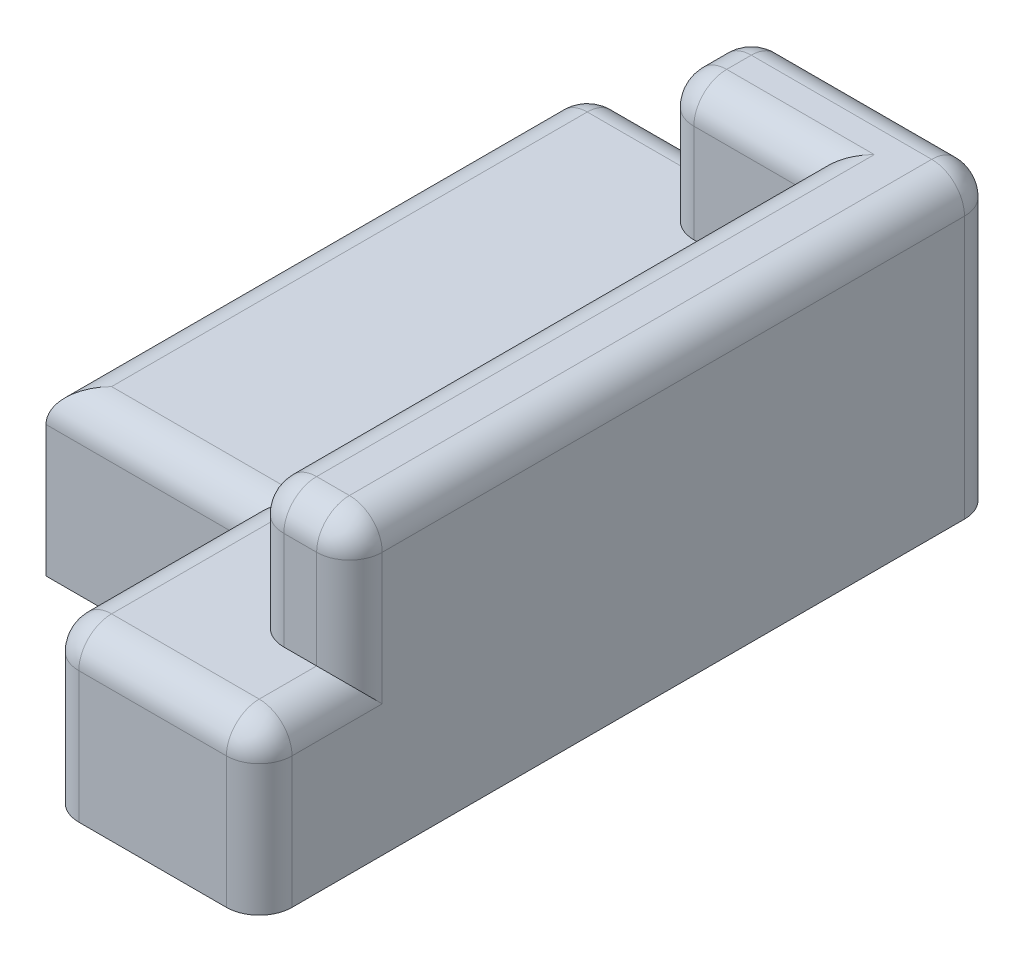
ISO-10303-21;
HEADER;
FILE_DESCRIPTION(('STEP AP214'),'2;1');
FILE_NAME('part.step','',(''),(''),'','','');
FILE_SCHEMA(('AUTOMOTIVE_DESIGN { 1 0 10303 214 1 1 1 1 }'));
ENDSEC;
DATA;
#1=APPLICATION_CONTEXT('core data for automotive mechanical design processes');
#2=APPLICATION_PROTOCOL_DEFINITION('international standard','automotive_design',2000,#1);
#3=PRODUCT_CONTEXT('',#1,'mechanical');
#4=PRODUCT('Part','Part','',(#3));
#5=PRODUCT_RELATED_PRODUCT_CATEGORY('part','',(#4));
#6=PRODUCT_DEFINITION_FORMATION('','',#4);
#7=PRODUCT_DEFINITION_CONTEXT('part definition',#1,'design');
#8=PRODUCT_DEFINITION('design','',#6,#7);
#9=PRODUCT_DEFINITION_SHAPE('','',#8);
#10=(LENGTH_UNIT() NAMED_UNIT(*) SI_UNIT(.MILLI.,.METRE.));
#11=(NAMED_UNIT(*) PLANE_ANGLE_UNIT() SI_UNIT($,.RADIAN.));
#12=(NAMED_UNIT(*) SI_UNIT($,.STERADIAN.) SOLID_ANGLE_UNIT());
#13=UNCERTAINTY_MEASURE_WITH_UNIT(LENGTH_MEASURE(1.E-05),#10,'distance_accuracy_value','');
#14=(GEOMETRIC_REPRESENTATION_CONTEXT(3) GLOBAL_UNCERTAINTY_ASSIGNED_CONTEXT((#13)) GLOBAL_UNIT_ASSIGNED_CONTEXT((#10,
#11,#12)) REPRESENTATION_CONTEXT('',''));
#15=CARTESIAN_POINT('',(0.,0.,0.));
#16=DIRECTION('',(0.,0.,1.));
#17=DIRECTION('',(1.,0.,0.));
#18=AXIS2_PLACEMENT_3D('',#15,#16,#17);
#19=CARTESIAN_POINT('',(0.,10.,0.));
#20=DIRECTION('',(-1.,0.,0.));
#21=DIRECTION('',(0.,0.,1.));
#22=AXIS2_PLACEMENT_3D('',#19,#20,#21);
#23=PLANE('',#22);
#24=DIRECTION('',(0.,0.,-1.));
#25=VECTOR('',#24,1.);
#26=CARTESIAN_POINT('',(0.,8.,-45.));
#27=LINE('',#26,#25);
#28=CARTESIAN_POINT('',(0.,8.,-12.));
#29=VERTEX_POINT('',#28);
#30=CARTESIAN_POINT('',(0.,8.,-43.));
#31=VERTEX_POINT('',#30);
#32=EDGE_CURVE('E57',#29,#31,#27,.T.);
#33=ORIENTED_EDGE('',*,*,#32,.T.);
#34=DIRECTION('',(0.,-1.,0.));
#35=VECTOR('',#34,1.);
#36=CARTESIAN_POINT('',(0.,10.,-43.));
#37=LINE('',#36,#35);
#38=CARTESIAN_POINT('',(0.,0.,-43.));
#39=VERTEX_POINT('',#38);
#40=EDGE_CURVE('E428',#31,#39,#37,.T.);
#41=ORIENTED_EDGE('',*,*,#40,.T.);
#42=DIRECTION('',(0.,0.,-1.));
#43=VECTOR('',#42,1.);
#44=CARTESIAN_POINT('',(0.,0.,0.));
#45=LINE('',#44,#43);
#46=CARTESIAN_POINT('',(0.,0.,-12.));
#47=VERTEX_POINT('',#46);
#48=EDGE_CURVE('E286',#47,#39,#45,.T.);
#49=ORIENTED_EDGE('',*,*,#48,.F.);
#50=DIRECTION('',(0.,-1.,0.));
#51=VECTOR('',#50,1.);
#52=CARTESIAN_POINT('',(0.,0.,-12.));
#53=LINE('',#52,#51);
#54=EDGE_CURVE('E224',#29,#47,#53,.T.);
#55=ORIENTED_EDGE('',*,*,#54,.F.);
#56=EDGE_LOOP('',(#33,#41,#49,#55));
#57=FACE_BOUND('',#56,.T.);
#58=ADVANCED_FACE('F39',(#57),#23,.T.);
#59=CARTESIAN_POINT('',(0.,10.,0.));
#60=DIRECTION('',(0.,-1.,0.));
#61=DIRECTION('',(0.,0.,-1.));
#62=AXIS2_PLACEMENT_3D('',#59,#60,#61);
#63=PLANE('',#62);
#64=DIRECTION('',(-1.,0.,0.));
#65=VECTOR('',#64,1.);
#66=CARTESIAN_POINT('',(0.,10.,-2.));
#67=LINE('',#66,#65);
#68=CARTESIAN_POINT('',(14.,10.,-2.));
#69=VERTEX_POINT('',#68);
#70=CARTESIAN_POINT('',(23.,10.,-2.));
#71=VERTEX_POINT('',#70);
#72=EDGE_CURVE('E404',#69,#71,#67,.F.);
#73=ORIENTED_EDGE('',*,*,#72,.T.);
#74=DIRECTION('',(0.,0.,1.));
#75=VECTOR('',#74,1.);
#76=CARTESIAN_POINT('',(23.,10.,0.));
#77=LINE('',#76,#75);
#78=CARTESIAN_POINT('',(23.,10.,-5.5));
#79=VERTEX_POINT('',#78);
#80=EDGE_CURVE('E407',#71,#79,#77,.F.);
#81=ORIENTED_EDGE('',*,*,#80,.T.);
#82=DIRECTION('',(-1.,0.,0.));
#83=VECTOR('',#82,1.);
#84=CARTESIAN_POINT('',(25.,10.,-5.5));
#85=LINE('',#84,#83);
#86=CARTESIAN_POINT('',(21.,10.,-5.5));
#87=VERTEX_POINT('',#86);
#88=EDGE_CURVE('E246',#79,#87,#85,.T.);
#89=ORIENTED_EDGE('',*,*,#88,.T.);
#90=CARTESIAN_POINT('',(21.,10.,-7.5));
#91=DIRECTION('',(0.,-1.,0.));
#92=DIRECTION('',(0.,0.,-1.));
#93=AXIS2_PLACEMENT_3D('',#90,#91,#92);
#94=CIRCLE('',#93,2.);
#95=CARTESIAN_POINT('',(19.,10.,-7.5));
#96=VERTEX_POINT('',#95);
#97=EDGE_CURVE('E49',#87,#96,#94,.T.);
#98=ORIENTED_EDGE('',*,*,#97,.T.);
#99=DIRECTION('',(0.,0.,1.));
#100=VECTOR('',#99,1.);
#101=CARTESIAN_POINT('',(19.,10.,-39.5));
#102=LINE('',#101,#100);
#103=CARTESIAN_POINT('',(19.,10.,-39.5));
#104=VERTEX_POINT('',#103);
#105=EDGE_CURVE('E275',#104,#96,#102,.T.);
#106=ORIENTED_EDGE('',*,*,#105,.F.);
#107=DIRECTION('',(1.,0.,0.));
#108=VECTOR('',#107,1.);
#109=CARTESIAN_POINT('',(0.,10.,-39.5));
#110=LINE('',#109,#108);
#111=CARTESIAN_POINT('',(12.,10.,-39.5));
#112=VERTEX_POINT('',#111);
#113=EDGE_CURVE('E279',#112,#104,#110,.T.);
#114=ORIENTED_EDGE('',*,*,#113,.F.);
#115=CARTESIAN_POINT('',(12.,10.,-41.5));
#116=DIRECTION('',(0.,-1.,0.));
#117=DIRECTION('',(0.,0.,-1.));
#118=AXIS2_PLACEMENT_3D('',#115,#116,#117);
#119=CIRCLE('',#118,2.);
#120=CARTESIAN_POINT('',(10.,10.,-41.5));
#121=VERTEX_POINT('',#120);
#122=EDGE_CURVE('E11',#112,#121,#119,.T.);
#123=ORIENTED_EDGE('',*,*,#122,.T.);
#124=DIRECTION('',(0.,0.,-1.));
#125=VECTOR('',#124,1.);
#126=CARTESIAN_POINT('',(10.,10.,-9.76786250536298));
#127=LINE('',#126,#125);
#128=CARTESIAN_POINT('',(10.,10.,-43.));
#129=VERTEX_POINT('',#128);
#130=EDGE_CURVE('E233',#121,#129,#127,.T.);
#131=ORIENTED_EDGE('',*,*,#130,.T.);
#132=DIRECTION('',(-1.,0.,0.));
#133=VECTOR('',#132,1.);
#134=CARTESIAN_POINT('',(0.,10.,-43.));
#135=LINE('',#134,#133);
#136=CARTESIAN_POINT('',(2.,10.,-43.));
#137=VERTEX_POINT('',#136);
#138=EDGE_CURVE('E392',#129,#137,#135,.T.);
#139=ORIENTED_EDGE('',*,*,#138,.T.);
#140=DIRECTION('',(0.,0.,-1.));
#141=VECTOR('',#140,1.);
#142=CARTESIAN_POINT('',(2.,10.,-12.));
#143=LINE('',#142,#141);
#144=CARTESIAN_POINT('',(2.,10.,-14.));
#145=VERTEX_POINT('',#144);
#146=EDGE_CURVE('E395',#137,#145,#143,.F.);
#147=ORIENTED_EDGE('',*,*,#146,.T.);
#148=DIRECTION('',(1.,0.,0.));
#149=VECTOR('',#148,1.);
#150=CARTESIAN_POINT('',(0.,10.,-14.));
#151=LINE('',#150,#149);
#152=CARTESIAN_POINT('',(14.,10.,-14.));
#153=VERTEX_POINT('',#152);
#154=EDGE_CURVE('E398',#145,#153,#151,.T.);
#155=ORIENTED_EDGE('',*,*,#154,.T.);
#156=DIRECTION('',(0.,0.,-1.));
#157=VECTOR('',#156,1.);
#158=CARTESIAN_POINT('',(14.,10.,0.));
#159=LINE('',#158,#157);
#160=EDGE_CURVE('E401',#153,#69,#159,.F.);
#161=ORIENTED_EDGE('',*,*,#160,.T.);
#162=EDGE_LOOP('',(#73,#81,#89,#98,#106,#114,#123,#131,#139,#147,#155,#161));
#163=FACE_BOUND('',#162,.T.);
#164=ADVANCED_FACE('F552',(#163),#63,.F.);
#165=CARTESIAN_POINT('',(0.,10.,0.));
#166=DIRECTION('',(0.,0.,-1.));
#167=DIRECTION('',(-1.,0.,0.));
#168=AXIS2_PLACEMENT_3D('',#165,#166,#167);
#169=PLANE('',#168);
#170=DIRECTION('',(1.,0.,0.));
#171=VECTOR('',#170,1.);
#172=CARTESIAN_POINT('',(0.,0.,0.));
#173=LINE('',#172,#171);
#174=CARTESIAN_POINT('',(14.,0.,0.));
#175=VERTEX_POINT('',#174);
#176=CARTESIAN_POINT('',(23.,0.,0.));
#177=VERTEX_POINT('',#176);
#178=EDGE_CURVE('E296',#175,#177,#173,.T.);
#179=ORIENTED_EDGE('',*,*,#178,.T.);
#180=DIRECTION('',(0.,-1.,0.));
#181=VECTOR('',#180,1.);
#182=CARTESIAN_POINT('',(23.,10.,0.));
#183=LINE('',#182,#181);
#184=CARTESIAN_POINT('',(23.,8.,0.));
#185=VERTEX_POINT('',#184);
#186=EDGE_CURVE('E416',#177,#185,#183,.F.);
#187=ORIENTED_EDGE('',*,*,#186,.T.);
#188=DIRECTION('',(-1.,0.,0.));
#189=VECTOR('',#188,1.);
#190=CARTESIAN_POINT('',(0.,8.,0.));
#191=LINE('',#190,#189);
#192=CARTESIAN_POINT('',(14.,8.,0.));
#193=VERTEX_POINT('',#192);
#194=EDGE_CURVE('E413',#185,#193,#191,.T.);
#195=ORIENTED_EDGE('',*,*,#194,.T.);
#196=DIRECTION('',(0.,1.,0.));
#197=VECTOR('',#196,1.);
#198=CARTESIAN_POINT('',(14.,0.,0.));
#199=LINE('',#198,#197);
#200=EDGE_CURVE('E410',#193,#175,#199,.F.);
#201=ORIENTED_EDGE('',*,*,#200,.T.);
#202=EDGE_LOOP('',(#179,#187,#195,#201));
#203=FACE_BOUND('',#202,.T.);
#204=ADVANCED_FACE('F625',(#203),#169,.F.);
#205=CARTESIAN_POINT('',(25.,10.,0.));
#206=DIRECTION('',(-1.,0.,0.));
#207=DIRECTION('',(0.,0.,1.));
#208=AXIS2_PLACEMENT_3D('',#205,#206,#207);
#209=PLANE('',#208);
#210=DIRECTION('',(0.,0.,-1.));
#211=VECTOR('',#210,1.);
#212=CARTESIAN_POINT('',(25.,0.,0.));
#213=LINE('',#212,#211);
#214=CARTESIAN_POINT('',(25.,0.,-2.));
#215=VERTEX_POINT('',#214);
#216=CARTESIAN_POINT('',(25.,0.,-43.));
#217=VERTEX_POINT('',#216);
#218=EDGE_CURVE('E292',#215,#217,#213,.T.);
#219=ORIENTED_EDGE('',*,*,#218,.T.);
#220=DIRECTION('',(0.,-1.,0.));
#221=VECTOR('',#220,1.);
#222=CARTESIAN_POINT('',(25.,18.,-43.));
#223=LINE('',#222,#221);
#224=CARTESIAN_POINT('',(25.,16.,-43.));
#225=VERTEX_POINT('',#224);
#226=EDGE_CURVE('E369',#217,#225,#223,.F.);
#227=ORIENTED_EDGE('',*,*,#226,.T.);
#228=DIRECTION('',(0.,0.,1.));
#229=VECTOR('',#228,1.);
#230=CARTESIAN_POINT('',(25.,16.,0.));
#231=LINE('',#230,#229);
#232=CARTESIAN_POINT('',(25.,16.,-7.5));
#233=VERTEX_POINT('',#232);
#234=EDGE_CURVE('E366',#225,#233,#231,.T.);
#235=ORIENTED_EDGE('',*,*,#234,.T.);
#236=DIRECTION('',(0.,-1.,0.));
#237=VECTOR('',#236,1.);
#238=CARTESIAN_POINT('',(25.,10.,-7.5));
#239=LINE('',#238,#237);
#240=CARTESIAN_POINT('',(25.,8.,-7.5));
#241=VERTEX_POINT('',#240);
#242=EDGE_CURVE('E363',#233,#241,#239,.T.);
#243=ORIENTED_EDGE('',*,*,#242,.T.);
#244=DIRECTION('',(0.,0.,1.));
#245=VECTOR('',#244,1.);
#246=CARTESIAN_POINT('',(25.,8.,0.));
#247=LINE('',#246,#245);
#248=CARTESIAN_POINT('',(25.,8.,-2.));
#249=VERTEX_POINT('',#248);
#250=EDGE_CURVE('E360',#241,#249,#247,.T.);
#251=ORIENTED_EDGE('',*,*,#250,.T.);
#252=DIRECTION('',(0.,-1.,0.));
#253=VECTOR('',#252,1.);
#254=CARTESIAN_POINT('',(25.,10.,-2.));
#255=LINE('',#254,#253);
#256=EDGE_CURVE('E357',#249,#215,#255,.T.);
#257=ORIENTED_EDGE('',*,*,#256,.T.);
#258=EDGE_LOOP('',(#219,#227,#235,#243,#251,#257));
#259=FACE_BOUND('',#258,.T.);
#260=ADVANCED_FACE('F1012',(#259),#209,.F.);
#261=CARTESIAN_POINT('',(0.,10.,-45.));
#262=DIRECTION('',(0.,0.,-1.));
#263=DIRECTION('',(-1.,0.,0.));
#264=AXIS2_PLACEMENT_3D('',#261,#262,#263);
#265=PLANE('',#264);
#266=DIRECTION('',(-1.,0.,0.));
#267=VECTOR('',#266,1.);
#268=CARTESIAN_POINT('',(25.,16.,-45.));
#269=LINE('',#268,#267);
#270=CARTESIAN_POINT('',(12.,16.,-45.));
#271=VERTEX_POINT('',#270);
#272=CARTESIAN_POINT('',(23.,16.,-45.));
#273=VERTEX_POINT('',#272);
#274=EDGE_CURVE('E350',#271,#273,#269,.F.);
#275=ORIENTED_EDGE('',*,*,#274,.T.);
#276=DIRECTION('',(0.,-1.,0.));
#277=VECTOR('',#276,1.);
#278=CARTESIAN_POINT('',(23.,0.,-45.));
#279=LINE('',#278,#277);
#280=CARTESIAN_POINT('',(23.,0.,-45.));
#281=VERTEX_POINT('',#280);
#282=EDGE_CURVE('E354',#273,#281,#279,.T.);
#283=ORIENTED_EDGE('',*,*,#282,.T.);
#284=DIRECTION('',(1.,0.,0.));
#285=VECTOR('',#284,1.);
#286=CARTESIAN_POINT('',(0.,0.,-45.));
#287=LINE('',#286,#285);
#288=CARTESIAN_POINT('',(2.,0.,-45.));
#289=VERTEX_POINT('',#288);
#290=EDGE_CURVE('E289',#289,#281,#287,.T.);
#291=ORIENTED_EDGE('',*,*,#290,.F.);
#292=DIRECTION('',(0.,-1.,0.));
#293=VECTOR('',#292,1.);
#294=CARTESIAN_POINT('',(2.,10.,-45.));
#295=LINE('',#294,#293);
#296=CARTESIAN_POINT('',(2.,8.,-45.));
#297=VERTEX_POINT('',#296);
#298=EDGE_CURVE('E347',#289,#297,#295,.F.);
#299=ORIENTED_EDGE('',*,*,#298,.T.);
#300=DIRECTION('',(-1.,0.,0.));
#301=VECTOR('',#300,1.);
#302=CARTESIAN_POINT('',(10.,8.,-45.));
#303=LINE('',#302,#301);
#304=CARTESIAN_POINT('',(12.,8.,-45.));
#305=VERTEX_POINT('',#304);
#306=EDGE_CURVE('E344',#297,#305,#303,.F.);
#307=ORIENTED_EDGE('',*,*,#306,.T.);
#308=DIRECTION('',(0.,-1.,0.));
#309=VECTOR('',#308,1.);
#310=CARTESIAN_POINT('',(12.,18.,-45.));
#311=LINE('',#310,#309);
#312=EDGE_CURVE('E341',#305,#271,#311,.F.);
#313=ORIENTED_EDGE('',*,*,#312,.T.);
#314=EDGE_LOOP('',(#275,#283,#291,#299,#307,#313));
#315=FACE_BOUND('',#314,.T.);
#316=ADVANCED_FACE('F629',(#315),#265,.T.);
#317=CARTESIAN_POINT('',(0.,0.,0.));
#318=DIRECTION('',(0.,-1.,0.));
#319=DIRECTION('',(0.,0.,-1.));
#320=AXIS2_PLACEMENT_3D('',#317,#318,#319);
#321=PLANE('',#320);
#322=ORIENTED_EDGE('',*,*,#290,.T.);
#323=CARTESIAN_POINT('',(23.,0.,-43.));
#324=DIRECTION('',(0.,-1.,0.));
#325=DIRECTION('',(0.,0.,-1.));
#326=AXIS2_PLACEMENT_3D('',#323,#324,#325);
#327=CIRCLE('',#326,2.);
#328=EDGE_CURVE('E389',#281,#217,#327,.T.);
#329=ORIENTED_EDGE('',*,*,#328,.T.);
#330=ORIENTED_EDGE('',*,*,#218,.F.);
#331=CARTESIAN_POINT('',(23.,0.,-2.));
#332=DIRECTION('',(0.,-1.,0.));
#333=DIRECTION('',(0.,0.,-1.));
#334=AXIS2_PLACEMENT_3D('',#331,#332,#333);
#335=CIRCLE('',#334,2.);
#336=EDGE_CURVE('E386',#215,#177,#335,.T.);
#337=ORIENTED_EDGE('',*,*,#336,.T.);
#338=ORIENTED_EDGE('',*,*,#178,.F.);
#339=CARTESIAN_POINT('',(14.,0.,-2.));
#340=DIRECTION('',(0.,-1.,0.));
#341=DIRECTION('',(0.,0.,-1.));
#342=AXIS2_PLACEMENT_3D('',#339,#340,#341);
#343=CIRCLE('',#342,2.);
#344=CARTESIAN_POINT('',(12.,0.,-2.));
#345=VERTEX_POINT('',#344);
#346=EDGE_CURVE('E240',#175,#345,#343,.T.);
#347=ORIENTED_EDGE('',*,*,#346,.T.);
#348=DIRECTION('',(0.,0.,1.));
#349=VECTOR('',#348,1.);
#350=CARTESIAN_POINT('',(12.,0.,0.));
#351=LINE('',#350,#349);
#352=CARTESIAN_POINT('',(12.,0.,-12.));
#353=VERTEX_POINT('',#352);
#354=EDGE_CURVE('E218',#353,#345,#351,.T.);
#355=ORIENTED_EDGE('',*,*,#354,.F.);
#356=DIRECTION('',(-1.,0.,0.));
#357=VECTOR('',#356,1.);
#358=CARTESIAN_POINT('',(12.,0.,-12.));
#359=LINE('',#358,#357);
#360=EDGE_CURVE('E227',#353,#47,#359,.T.);
#361=ORIENTED_EDGE('',*,*,#360,.T.);
#362=ORIENTED_EDGE('',*,*,#48,.T.);
#363=CARTESIAN_POINT('',(2.,0.,-43.));
#364=DIRECTION('',(0.,-1.,0.));
#365=DIRECTION('',(0.,0.,-1.));
#366=AXIS2_PLACEMENT_3D('',#363,#364,#365);
#367=CIRCLE('',#366,2.);
#368=EDGE_CURVE('E381',#39,#289,#367,.T.);
#369=ORIENTED_EDGE('',*,*,#368,.T.);
#370=EDGE_LOOP('',(#322,#329,#330,#337,#338,#347,#355,#361,#362,#369));
#371=FACE_BOUND('',#370,.T.);
#372=CARTESIAN_POINT('',(20.,0.,-3.));
#373=DIRECTION('',(0.,-1.,0.));
#374=DIRECTION('',(0.,0.,-1.));
#375=AXIS2_PLACEMENT_3D('',#372,#373,#374);
#376=CIRCLE('',#375,1.99999999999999);
#377=CARTESIAN_POINT('',(20.,0.,-4.99999999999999));
#378=VERTEX_POINT('',#377);
#379=EDGE_CURVE('E251',#378,#378,#376,.T.);
#380=ORIENTED_EDGE('',*,*,#379,.F.);
#381=EDGE_LOOP('',(#380));
#382=FACE_BOUND('',#381,.T.);
#383=CARTESIAN_POINT('',(20.,0.,-42.));
#384=DIRECTION('',(0.,-1.,0.));
#385=DIRECTION('',(0.,0.,-1.));
#386=AXIS2_PLACEMENT_3D('',#383,#384,#385);
#387=CIRCLE('',#386,1.99999999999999);
#388=CARTESIAN_POINT('',(20.,0.,-44.));
#389=VERTEX_POINT('',#388);
#390=EDGE_CURVE('E259',#389,#389,#387,.T.);
#391=ORIENTED_EDGE('',*,*,#390,.F.);
#392=EDGE_LOOP('',(#391));
#393=FACE_BOUND('',#392,.T.);
#394=CARTESIAN_POINT('',(5.,0.,-42.));
#395=DIRECTION('',(0.,-1.,0.));
#396=DIRECTION('',(0.,0.,-1.));
#397=AXIS2_PLACEMENT_3D('',#394,#395,#396);
#398=CIRCLE('',#397,1.99999999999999);
#399=CARTESIAN_POINT('',(5.,0.,-44.));
#400=VERTEX_POINT('',#399);
#401=EDGE_CURVE('E267',#400,#400,#398,.T.);
#402=ORIENTED_EDGE('',*,*,#401,.F.);
#403=EDGE_LOOP('',(#402));
#404=FACE_BOUND('',#403,.T.);
#405=ADVANCED_FACE('F236',(#371,#382,#393,#404),#321,.T.);
#406=CARTESIAN_POINT('',(19.,38.,-39.5));
#407=DIRECTION('',(1.,0.,0.));
#408=DIRECTION('',(0.,0.,-1.));
#409=AXIS2_PLACEMENT_3D('',#406,#407,#408);
#410=PLANE('',#409);
#411=DIRECTION('',(0.,1.,0.));
#412=VECTOR('',#411,1.);
#413=CARTESIAN_POINT('',(19.,38.,-7.5));
#414=LINE('',#413,#412);
#415=CARTESIAN_POINT('',(19.,16.,-7.5));
#416=VERTEX_POINT('',#415);
#417=EDGE_CURVE('E300',#96,#416,#414,.T.);
#418=ORIENTED_EDGE('',*,*,#417,.T.);
#419=DIRECTION('',(0.,0.,-1.));
#420=VECTOR('',#419,1.);
#421=CARTESIAN_POINT('',(19.,16.,-39.5));
#422=LINE('',#421,#420);
#423=CARTESIAN_POINT('',(19.,16.,-39.5));
#424=VERTEX_POINT('',#423);
#425=EDGE_CURVE('E303',#416,#424,#422,.T.);
#426=ORIENTED_EDGE('',*,*,#425,.T.);
#427=DIRECTION('',(0.,-1.,0.));
#428=VECTOR('',#427,1.);
#429=CARTESIAN_POINT('',(19.,38.,-39.5));
#430=LINE('',#429,#428);
#431=EDGE_CURVE('E282',#424,#104,#430,.T.);
#432=ORIENTED_EDGE('',*,*,#431,.T.);
#433=ORIENTED_EDGE('',*,*,#105,.T.);
#434=EDGE_LOOP('',(#418,#426,#432,#433));
#435=FACE_BOUND('',#434,.T.);
#436=ADVANCED_FACE('F565',(#435),#410,.F.);
#437=CARTESIAN_POINT('',(0.,38.,-39.5));
#438=DIRECTION('',(0.,0.,-1.));
#439=DIRECTION('',(-1.,0.,0.));
#440=AXIS2_PLACEMENT_3D('',#437,#438,#439);
#441=PLANE('',#440);
#442=ORIENTED_EDGE('',*,*,#431,.F.);
#443=DIRECTION('',(-1.,0.,0.));
#444=VECTOR('',#443,1.);
#445=CARTESIAN_POINT('',(0.,16.,-39.5));
#446=LINE('',#445,#444);
#447=CARTESIAN_POINT('',(12.,16.,-39.5));
#448=VERTEX_POINT('',#447);
#449=EDGE_CURVE('E329',#424,#448,#446,.T.);
#450=ORIENTED_EDGE('',*,*,#449,.T.);
#451=DIRECTION('',(0.,1.,0.));
#452=VECTOR('',#451,1.);
#453=CARTESIAN_POINT('',(12.,38.,-39.5));
#454=LINE('',#453,#452);
#455=EDGE_CURVE('E326',#448,#112,#454,.F.);
#456=ORIENTED_EDGE('',*,*,#455,.T.);
#457=ORIENTED_EDGE('',*,*,#113,.T.);
#458=EDGE_LOOP('',(#442,#450,#456,#457));
#459=FACE_BOUND('',#458,.T.);
#460=ADVANCED_FACE('F983',(#459),#441,.F.);
#461=CARTESIAN_POINT('',(5.,5.,-42.));
#462=DIRECTION('',(0.,-1.,0.));
#463=DIRECTION('',(0.,0.,-1.));
#464=AXIS2_PLACEMENT_3D('',#461,#462,#463);
#465=CONICAL_SURFACE('',#464,2.,1.02974425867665);
#466=CARTESIAN_POINT('',(5.,6.20172123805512,-42.));
#467=VERTEX_POINT('',#466);
#468=VERTEX_LOOP('',#467);
#469=FACE_BOUND('',#468,.T.);
#470=CARTESIAN_POINT('',(5.,5.,-42.));
#471=DIRECTION('',(0.,-1.,0.));
#472=DIRECTION('',(0.,0.,-1.));
#473=AXIS2_PLACEMENT_3D('',#470,#471,#472);
#474=CIRCLE('',#473,2.);
#475=CARTESIAN_POINT('',(5.,5.,-44.));
#476=VERTEX_POINT('',#475);
#477=EDGE_CURVE('E271',#476,#476,#474,.T.);
#478=ORIENTED_EDGE('',*,*,#477,.T.);
#479=EDGE_LOOP('',(#478));
#480=FACE_BOUND('',#479,.T.);
#481=ADVANCED_FACE('F974',(#469,#480),#465,.F.);
#482=CARTESIAN_POINT('',(5.,0.,-42.));
#483=DIRECTION('',(0.,-1.,0.));
#484=DIRECTION('',(0.,0.,-1.));
#485=AXIS2_PLACEMENT_3D('',#482,#483,#484);
#486=CYLINDRICAL_SURFACE('',#485,1.99999999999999);
#487=ORIENTED_EDGE('',*,*,#477,.F.);
#488=EDGE_LOOP('',(#487));
#489=FACE_BOUND('',#488,.T.);
#490=ORIENTED_EDGE('',*,*,#401,.T.);
#491=EDGE_LOOP('',(#490));
#492=FACE_BOUND('',#491,.T.);
#493=ADVANCED_FACE('F964',(#489,#492),#486,.F.);
#494=CARTESIAN_POINT('',(20.,5.,-42.));
#495=DIRECTION('',(0.,-1.,0.));
#496=DIRECTION('',(0.,0.,-1.));
#497=AXIS2_PLACEMENT_3D('',#494,#495,#496);
#498=CONICAL_SURFACE('',#497,2.,1.02974425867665);
#499=CARTESIAN_POINT('',(20.,6.20172123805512,-42.));
#500=VERTEX_POINT('',#499);
#501=VERTEX_LOOP('',#500);
#502=FACE_BOUND('',#501,.T.);
#503=CARTESIAN_POINT('',(20.,5.,-42.));
#504=DIRECTION('',(0.,-1.,0.));
#505=DIRECTION('',(0.,0.,-1.));
#506=AXIS2_PLACEMENT_3D('',#503,#504,#505);
#507=CIRCLE('',#506,2.);
#508=CARTESIAN_POINT('',(20.,5.,-44.));
#509=VERTEX_POINT('',#508);
#510=EDGE_CURVE('E263',#509,#509,#507,.T.);
#511=ORIENTED_EDGE('',*,*,#510,.T.);
#512=EDGE_LOOP('',(#511));
#513=FACE_BOUND('',#512,.T.);
#514=ADVANCED_FACE('F954',(#502,#513),#498,.F.);
#515=CARTESIAN_POINT('',(20.,0.,-42.));
#516=DIRECTION('',(0.,-1.,0.));
#517=DIRECTION('',(0.,0.,-1.));
#518=AXIS2_PLACEMENT_3D('',#515,#516,#517);
#519=CYLINDRICAL_SURFACE('',#518,1.99999999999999);
#520=ORIENTED_EDGE('',*,*,#510,.F.);
#521=EDGE_LOOP('',(#520));
#522=FACE_BOUND('',#521,.T.);
#523=ORIENTED_EDGE('',*,*,#390,.T.);
#524=EDGE_LOOP('',(#523));
#525=FACE_BOUND('',#524,.T.);
#526=ADVANCED_FACE('F944',(#522,#525),#519,.F.);
#527=CARTESIAN_POINT('',(20.,5.,-3.));
#528=DIRECTION('',(0.,-1.,0.));
#529=DIRECTION('',(0.,0.,-1.));
#530=AXIS2_PLACEMENT_3D('',#527,#528,#529);
#531=CONICAL_SURFACE('',#530,2.,1.02974425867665);
#532=CARTESIAN_POINT('',(20.,6.20172123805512,-3.));
#533=VERTEX_POINT('',#532);
#534=VERTEX_LOOP('',#533);
#535=FACE_BOUND('',#534,.T.);
#536=CARTESIAN_POINT('',(20.,5.,-3.));
#537=DIRECTION('',(0.,-1.,0.));
#538=DIRECTION('',(0.,0.,-1.));
#539=AXIS2_PLACEMENT_3D('',#536,#537,#538);
#540=CIRCLE('',#539,2.);
#541=CARTESIAN_POINT('',(20.,5.,-5.));
#542=VERTEX_POINT('',#541);
#543=EDGE_CURVE('E255',#542,#542,#540,.T.);
#544=ORIENTED_EDGE('',*,*,#543,.T.);
#545=EDGE_LOOP('',(#544));
#546=FACE_BOUND('',#545,.T.);
#547=ADVANCED_FACE('F933',(#535,#546),#531,.F.);
#548=CARTESIAN_POINT('',(20.,0.,-3.));
#549=DIRECTION('',(0.,-1.,0.));
#550=DIRECTION('',(0.,0.,-1.));
#551=AXIS2_PLACEMENT_3D('',#548,#549,#550);
#552=CYLINDRICAL_SURFACE('',#551,1.99999999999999);
#553=ORIENTED_EDGE('',*,*,#543,.F.);
#554=EDGE_LOOP('',(#553));
#555=FACE_BOUND('',#554,.T.);
#556=ORIENTED_EDGE('',*,*,#379,.T.);
#557=EDGE_LOOP('',(#556));
#558=FACE_BOUND('',#557,.T.);
#559=ADVANCED_FACE('F929',(#555,#558),#552,.F.);
#560=CARTESIAN_POINT('',(10.,10.,-9.76786250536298));
#561=DIRECTION('',(1.,0.,0.));
#562=DIRECTION('',(0.,0.,-1.));
#563=AXIS2_PLACEMENT_3D('',#560,#561,#562);
#564=PLANE('',#563);
#565=ORIENTED_EDGE('',*,*,#130,.F.);
#566=DIRECTION('',(0.,1.,0.));
#567=VECTOR('',#566,1.);
#568=CARTESIAN_POINT('',(10.,10.,-41.5));
#569=LINE('',#568,#567);
#570=CARTESIAN_POINT('',(10.,16.,-41.5));
#571=VERTEX_POINT('',#570);
#572=EDGE_CURVE('E338',#121,#571,#569,.T.);
#573=ORIENTED_EDGE('',*,*,#572,.T.);
#574=DIRECTION('',(0.,0.,-1.));
#575=VECTOR('',#574,1.);
#576=CARTESIAN_POINT('',(10.,16.,-9.76786250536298));
#577=LINE('',#576,#575);
#578=CARTESIAN_POINT('',(10.,16.,-43.));
#579=VERTEX_POINT('',#578);
#580=EDGE_CURVE('E335',#571,#579,#577,.T.);
#581=ORIENTED_EDGE('',*,*,#580,.T.);
#582=DIRECTION('',(0.,-1.,0.));
#583=VECTOR('',#582,1.);
#584=CARTESIAN_POINT('',(10.,10.,-43.));
#585=LINE('',#584,#583);
#586=EDGE_CURVE('E332',#579,#129,#585,.T.);
#587=ORIENTED_EDGE('',*,*,#586,.T.);
#588=EDGE_LOOP('',(#565,#573,#581,#587));
#589=FACE_BOUND('',#588,.T.);
#590=ADVANCED_FACE('F579',(#589),#564,.F.);
#591=CARTESIAN_POINT('',(12.,0.,-12.));
#592=DIRECTION('',(0.,0.,-1.));
#593=DIRECTION('',(-1.,0.,0.));
#594=AXIS2_PLACEMENT_3D('',#591,#592,#593);
#595=PLANE('',#594);
#596=DIRECTION('',(0.,-1.,0.));
#597=VECTOR('',#596,1.);
#598=CARTESIAN_POINT('',(12.,0.,-12.));
#599=LINE('',#598,#597);
#600=CARTESIAN_POINT('',(12.,8.,-12.));
#601=VERTEX_POINT('',#600);
#602=EDGE_CURVE('E214',#601,#353,#599,.T.);
#603=ORIENTED_EDGE('',*,*,#602,.F.);
#604=DIRECTION('',(1.,0.,0.));
#605=VECTOR('',#604,1.);
#606=CARTESIAN_POINT('',(12.,8.,-12.));
#607=LINE('',#606,#605);
#608=EDGE_CURVE('E65',#601,#29,#607,.F.);
#609=ORIENTED_EDGE('',*,*,#608,.T.);
#610=ORIENTED_EDGE('',*,*,#54,.T.);
#611=ORIENTED_EDGE('',*,*,#360,.F.);
#612=EDGE_LOOP('',(#603,#609,#610,#611));
#613=FACE_BOUND('',#612,.T.);
#614=ADVANCED_FACE('F228',(#613),#595,.F.);
#615=CARTESIAN_POINT('',(12.,0.,0.));
#616=DIRECTION('',(-1.,0.,0.));
#617=DIRECTION('',(0.,0.,1.));
#618=AXIS2_PLACEMENT_3D('',#615,#616,#617);
#619=PLANE('',#618);
#620=DIRECTION('',(0.,1.,0.));
#621=VECTOR('',#620,1.);
#622=CARTESIAN_POINT('',(12.,10.,-2.));
#623=LINE('',#622,#621);
#624=CARTESIAN_POINT('',(12.,8.,-2.));
#625=VERTEX_POINT('',#624);
#626=EDGE_CURVE('E419',#345,#625,#623,.T.);
#627=ORIENTED_EDGE('',*,*,#626,.T.);
#628=DIRECTION('',(0.,0.,-1.));
#629=VECTOR('',#628,1.);
#630=CARTESIAN_POINT('',(12.,8.,-12.));
#631=LINE('',#630,#629);
#632=EDGE_CURVE('E221',#625,#601,#631,.T.);
#633=ORIENTED_EDGE('',*,*,#632,.T.);
#634=ORIENTED_EDGE('',*,*,#602,.T.);
#635=ORIENTED_EDGE('',*,*,#354,.T.);
#636=EDGE_LOOP('',(#627,#633,#634,#635));
#637=FACE_BOUND('',#636,.T.);
#638=ADVANCED_FACE('F216',(#637),#619,.T.);
#639=CARTESIAN_POINT('',(25.,18.,-45.));
#640=DIRECTION('',(0.,-1.,0.));
#641=DIRECTION('',(0.,0.,-1.));
#642=AXIS2_PLACEMENT_3D('',#639,#640,#641);
#643=PLANE('',#642);
#644=DIRECTION('',(-1.,0.,0.));
#645=VECTOR('',#644,1.);
#646=CARTESIAN_POINT('',(25.,18.,-41.5));
#647=LINE('',#646,#645);
#648=CARTESIAN_POINT('',(12.,18.,-41.5));
#649=VERTEX_POINT('',#648);
#650=CARTESIAN_POINT('',(21.,18.,-41.5));
#651=VERTEX_POINT('',#650);
#652=EDGE_CURVE('E319',#649,#651,#647,.F.);
#653=ORIENTED_EDGE('',*,*,#652,.T.);
#654=DIRECTION('',(0.,0.,-1.));
#655=VECTOR('',#654,1.);
#656=CARTESIAN_POINT('',(21.,18.,-45.));
#657=LINE('',#656,#655);
#658=CARTESIAN_POINT('',(21.,18.,-7.5));
#659=VERTEX_POINT('',#658);
#660=EDGE_CURVE('E322',#651,#659,#657,.F.);
#661=ORIENTED_EDGE('',*,*,#660,.T.);
#662=DIRECTION('',(-1.,0.,0.));
#663=VECTOR('',#662,1.);
#664=CARTESIAN_POINT('',(25.,18.,-7.5));
#665=LINE('',#664,#663);
#666=CARTESIAN_POINT('',(23.,18.,-7.5));
#667=VERTEX_POINT('',#666);
#668=EDGE_CURVE('E307',#659,#667,#665,.F.);
#669=ORIENTED_EDGE('',*,*,#668,.T.);
#670=DIRECTION('',(0.,0.,1.));
#671=VECTOR('',#670,1.);
#672=CARTESIAN_POINT('',(23.,18.,-45.));
#673=LINE('',#672,#671);
#674=CARTESIAN_POINT('',(23.,18.,-43.));
#675=VERTEX_POINT('',#674);
#676=EDGE_CURVE('E310',#667,#675,#673,.F.);
#677=ORIENTED_EDGE('',*,*,#676,.T.);
#678=DIRECTION('',(-1.,0.,0.));
#679=VECTOR('',#678,1.);
#680=CARTESIAN_POINT('',(10.,18.,-43.));
#681=LINE('',#680,#679);
#682=CARTESIAN_POINT('',(12.,18.,-43.));
#683=VERTEX_POINT('',#682);
#684=EDGE_CURVE('E313',#675,#683,#681,.T.);
#685=ORIENTED_EDGE('',*,*,#684,.T.);
#686=DIRECTION('',(0.,0.,-1.));
#687=VECTOR('',#686,1.);
#688=CARTESIAN_POINT('',(12.,18.,-45.));
#689=LINE('',#688,#687);
#690=EDGE_CURVE('E316',#683,#649,#689,.F.);
#691=ORIENTED_EDGE('',*,*,#690,.T.);
#692=EDGE_LOOP('',(#653,#661,#669,#677,#685,#691));
#693=FACE_BOUND('',#692,.T.);
#694=ADVANCED_FACE('F883',(#693),#643,.F.);
#695=CARTESIAN_POINT('',(25.,18.,-5.5));
#696=DIRECTION('',(0.,0.,-1.));
#697=DIRECTION('',(-1.,0.,0.));
#698=AXIS2_PLACEMENT_3D('',#695,#696,#697);
#699=PLANE('',#698);
#700=ORIENTED_EDGE('',*,*,#88,.F.);
#701=DIRECTION('',(0.,-1.,0.));
#702=VECTOR('',#701,1.);
#703=CARTESIAN_POINT('',(23.,18.,-5.5));
#704=LINE('',#703,#702);
#705=CARTESIAN_POINT('',(23.,16.,-5.5));
#706=VERTEX_POINT('',#705);
#707=EDGE_CURVE('E378',#79,#706,#704,.F.);
#708=ORIENTED_EDGE('',*,*,#707,.T.);
#709=DIRECTION('',(-1.,0.,0.));
#710=VECTOR('',#709,1.);
#711=CARTESIAN_POINT('',(25.,16.,-5.5));
#712=LINE('',#711,#710);
#713=CARTESIAN_POINT('',(21.,16.,-5.5));
#714=VERTEX_POINT('',#713);
#715=EDGE_CURVE('E375',#706,#714,#712,.T.);
#716=ORIENTED_EDGE('',*,*,#715,.T.);
#717=DIRECTION('',(0.,1.,0.));
#718=VECTOR('',#717,1.);
#719=CARTESIAN_POINT('',(21.,18.,-5.5));
#720=LINE('',#719,#718);
#721=EDGE_CURVE('E372',#714,#87,#720,.F.);
#722=ORIENTED_EDGE('',*,*,#721,.T.);
#723=EDGE_LOOP('',(#700,#708,#716,#722));
#724=FACE_BOUND('',#723,.T.);
#725=ADVANCED_FACE('F875',(#724),#699,.F.);
#726=CARTESIAN_POINT('',(14.,0.,-2.));
#727=DIRECTION('',(0.,-1.,0.));
#728=DIRECTION('',(0.,0.,-1.));
#729=AXIS2_PLACEMENT_3D('',#726,#727,#728);
#730=CYLINDRICAL_SURFACE('',#729,2.);
#731=ORIENTED_EDGE('',*,*,#346,.F.);
#732=ORIENTED_EDGE('',*,*,#200,.F.);
#733=CARTESIAN_POINT('',(14.,8.,-2.));
#734=DIRECTION('',(0.,1.,0.));
#735=DIRECTION('',(0.,0.,1.));
#736=AXIS2_PLACEMENT_3D('',#733,#734,#735);
#737=CIRCLE('',#736,2.);
#738=EDGE_CURVE('E537',#625,#193,#737,.T.);
#739=ORIENTED_EDGE('',*,*,#738,.F.);
#740=ORIENTED_EDGE('',*,*,#626,.F.);
#741=EDGE_LOOP('',(#731,#732,#739,#740));
#742=FACE_BOUND('',#741,.T.);
#743=ADVANCED_FACE('F41',(#742),#730,.T.);
#744=CARTESIAN_POINT('',(14.,8.,0.));
#745=DIRECTION('',(0.,0.,1.));
#746=DIRECTION('',(1.,0.,0.));
#747=AXIS2_PLACEMENT_3D('',#744,#745,#746);
#748=CYLINDRICAL_SURFACE('',#747,2.);
#749=CARTESIAN_POINT('',(14.,8.,-2.));
#750=DIRECTION('',(0.,0.,1.));
#751=DIRECTION('',(1.,0.,0.));
#752=AXIS2_PLACEMENT_3D('',#749,#750,#751);
#753=CIRCLE('',#752,2.);
#754=EDGE_CURVE('E534',#69,#625,#753,.T.);
#755=ORIENTED_EDGE('',*,*,#754,.F.);
#756=ORIENTED_EDGE('',*,*,#160,.F.);
#757=CARTESIAN_POINT('',(14.,8.,-14.));
#758=DIRECTION('',(0.707106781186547,0.,0.707106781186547));
#759=DIRECTION('',(-0.707106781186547,0.,0.707106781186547));
#760=AXIS2_PLACEMENT_3D('',#757,#758,#759);
#761=ELLIPSE('',#760,2.82842712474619,2.);
#762=EDGE_CURVE('E43',#601,#153,#761,.F.);
#763=ORIENTED_EDGE('',*,*,#762,.F.);
#764=ORIENTED_EDGE('',*,*,#632,.F.);
#765=EDGE_LOOP('',(#755,#756,#763,#764));
#766=FACE_BOUND('',#765,.T.);
#767=ADVANCED_FACE('F612',(#766),#748,.T.);
#768=CARTESIAN_POINT('',(0.,8.,-14.));
#769=DIRECTION('',(1.,0.,0.));
#770=DIRECTION('',(0.,0.,-1.));
#771=AXIS2_PLACEMENT_3D('',#768,#769,#770);
#772=CYLINDRICAL_SURFACE('',#771,2.);
#773=ORIENTED_EDGE('',*,*,#762,.T.);
#774=ORIENTED_EDGE('',*,*,#154,.F.);
#775=CARTESIAN_POINT('',(2.,8.,-14.));
#776=DIRECTION('',(0.707106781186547,0.,0.707106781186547));
#777=DIRECTION('',(-0.707106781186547,0.,0.707106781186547));
#778=AXIS2_PLACEMENT_3D('',#775,#776,#777);
#779=ELLIPSE('',#778,2.82842712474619,2.);
#780=EDGE_CURVE('E530',#29,#145,#779,.F.);
#781=ORIENTED_EDGE('',*,*,#780,.F.);
#782=ORIENTED_EDGE('',*,*,#608,.F.);
#783=EDGE_LOOP('',(#773,#774,#781,#782));
#784=FACE_BOUND('',#783,.T.);
#785=ADVANCED_FACE('F609',(#784),#772,.T.);
#786=CARTESIAN_POINT('',(14.,8.,-2.));
#787=DIRECTION('',(0.,0.,1.));
#788=DIRECTION('',(1.,0.,0.));
#789=AXIS2_PLACEMENT_3D('',#786,#787,#788);
#790=SPHERICAL_SURFACE('',#789,2.);
#791=ORIENTED_EDGE('',*,*,#754,.T.);
#792=ORIENTED_EDGE('',*,*,#738,.T.);
#793=CARTESIAN_POINT('',(14.,8.,-2.));
#794=DIRECTION('',(-1.,0.,0.));
#795=DIRECTION('',(0.,0.,1.));
#796=AXIS2_PLACEMENT_3D('',#793,#794,#795);
#797=CIRCLE('',#796,2.);
#798=EDGE_CURVE('E526',#69,#193,#797,.F.);
#799=ORIENTED_EDGE('',*,*,#798,.F.);
#800=EDGE_LOOP('',(#791,#792,#799));
#801=FACE_BOUND('',#800,.T.);
#802=ADVANCED_FACE('F611',(#801),#790,.T.);
#803=CARTESIAN_POINT('',(2.,8.,0.));
#804=DIRECTION('',(0.,0.,1.));
#805=DIRECTION('',(1.,0.,0.));
#806=AXIS2_PLACEMENT_3D('',#803,#804,#805);
#807=CYLINDRICAL_SURFACE('',#806,2.);
#808=ORIENTED_EDGE('',*,*,#780,.T.);
#809=ORIENTED_EDGE('',*,*,#146,.F.);
#810=CARTESIAN_POINT('',(2.,8.,-43.));
#811=DIRECTION('',(0.,0.,-1.));
#812=DIRECTION('',(-1.,0.,0.));
#813=AXIS2_PLACEMENT_3D('',#810,#811,#812);
#814=CIRCLE('',#813,2.);
#815=EDGE_CURVE('E522',#31,#137,#814,.T.);
#816=ORIENTED_EDGE('',*,*,#815,.F.);
#817=ORIENTED_EDGE('',*,*,#32,.F.);
#818=EDGE_LOOP('',(#808,#809,#816,#817));
#819=FACE_BOUND('',#818,.T.);
#820=ADVANCED_FACE('F606',(#819),#807,.T.);
#821=CARTESIAN_POINT('',(2.,10.,-43.));
#822=DIRECTION('',(0.,-1.,0.));
#823=DIRECTION('',(0.,0.,-1.));
#824=AXIS2_PLACEMENT_3D('',#821,#822,#823);
#825=CYLINDRICAL_SURFACE('',#824,2.);
#826=ORIENTED_EDGE('',*,*,#368,.F.);
#827=ORIENTED_EDGE('',*,*,#40,.F.);
#828=CARTESIAN_POINT('',(2.,8.,-43.));
#829=DIRECTION('',(0.,1.,0.));
#830=DIRECTION('',(0.,0.,1.));
#831=AXIS2_PLACEMENT_3D('',#828,#829,#830);
#832=CIRCLE('',#831,2.);
#833=EDGE_CURVE('E518',#297,#31,#832,.T.);
#834=ORIENTED_EDGE('',*,*,#833,.F.);
#835=ORIENTED_EDGE('',*,*,#298,.F.);
#836=EDGE_LOOP('',(#826,#827,#834,#835));
#837=FACE_BOUND('',#836,.T.);
#838=ADVANCED_FACE('F704',(#837),#825,.T.);
#839=CARTESIAN_POINT('',(23.,10.,-2.));
#840=DIRECTION('',(0.,-1.,0.));
#841=DIRECTION('',(0.,0.,-1.));
#842=AXIS2_PLACEMENT_3D('',#839,#840,#841);
#843=CYLINDRICAL_SURFACE('',#842,2.);
#844=ORIENTED_EDGE('',*,*,#336,.F.);
#845=ORIENTED_EDGE('',*,*,#256,.F.);
#846=CARTESIAN_POINT('',(23.,8.,-2.));
#847=DIRECTION('',(0.,1.,0.));
#848=DIRECTION('',(0.,0.,1.));
#849=AXIS2_PLACEMENT_3D('',#846,#847,#848);
#850=CIRCLE('',#849,2.);
#851=EDGE_CURVE('E514',#185,#249,#850,.T.);
#852=ORIENTED_EDGE('',*,*,#851,.F.);
#853=ORIENTED_EDGE('',*,*,#186,.F.);
#854=EDGE_LOOP('',(#844,#845,#852,#853));
#855=FACE_BOUND('',#854,.T.);
#856=ADVANCED_FACE('F700',(#855),#843,.T.);
#857=CARTESIAN_POINT('',(0.,8.,-2.));
#858=DIRECTION('',(-1.,0.,0.));
#859=DIRECTION('',(0.,0.,1.));
#860=AXIS2_PLACEMENT_3D('',#857,#858,#859);
#861=CYLINDRICAL_SURFACE('',#860,2.);
#862=ORIENTED_EDGE('',*,*,#798,.T.);
#863=ORIENTED_EDGE('',*,*,#194,.F.);
#864=CARTESIAN_POINT('',(23.,8.,-2.));
#865=DIRECTION('',(1.,0.,0.));
#866=DIRECTION('',(0.,0.,-1.));
#867=AXIS2_PLACEMENT_3D('',#864,#865,#866);
#868=CIRCLE('',#867,2.);
#869=EDGE_CURVE('E510',#71,#185,#868,.T.);
#870=ORIENTED_EDGE('',*,*,#869,.F.);
#871=ORIENTED_EDGE('',*,*,#72,.F.);
#872=EDGE_LOOP('',(#862,#863,#870,#871));
#873=FACE_BOUND('',#872,.T.);
#874=ADVANCED_FACE('F697',(#873),#861,.T.);
#875=CARTESIAN_POINT('',(2.,8.,-43.));
#876=DIRECTION('',(0.,0.,1.));
#877=DIRECTION('',(1.,0.,0.));
#878=AXIS2_PLACEMENT_3D('',#875,#876,#877);
#879=SPHERICAL_SURFACE('',#878,2.);
#880=ORIENTED_EDGE('',*,*,#833,.T.);
#881=ORIENTED_EDGE('',*,*,#815,.T.);
#882=CARTESIAN_POINT('',(2.,8.,-43.));
#883=DIRECTION('',(-1.,0.,0.));
#884=DIRECTION('',(0.,0.,1.));
#885=AXIS2_PLACEMENT_3D('',#882,#883,#884);
#886=CIRCLE('',#885,2.);
#887=EDGE_CURVE('E506',#297,#137,#886,.F.);
#888=ORIENTED_EDGE('',*,*,#887,.F.);
#889=EDGE_LOOP('',(#880,#881,#888));
#890=FACE_BOUND('',#889,.T.);
#891=ADVANCED_FACE('F602',(#890),#879,.T.);
#892=CARTESIAN_POINT('',(23.,10.,-43.));
#893=DIRECTION('',(0.,1.,0.));
#894=DIRECTION('',(0.,0.,1.));
#895=AXIS2_PLACEMENT_3D('',#892,#893,#894);
#896=CYLINDRICAL_SURFACE('',#895,2.);
#897=ORIENTED_EDGE('',*,*,#328,.F.);
#898=ORIENTED_EDGE('',*,*,#282,.F.);
#899=CARTESIAN_POINT('',(23.,16.,-43.));
#900=DIRECTION('',(0.,1.,0.));
#901=DIRECTION('',(0.,0.,1.));
#902=AXIS2_PLACEMENT_3D('',#899,#900,#901);
#903=CIRCLE('',#902,2.);
#904=EDGE_CURVE('E502',#225,#273,#903,.T.);
#905=ORIENTED_EDGE('',*,*,#904,.F.);
#906=ORIENTED_EDGE('',*,*,#226,.F.);
#907=EDGE_LOOP('',(#897,#898,#905,#906));
#908=FACE_BOUND('',#907,.T.);
#909=ADVANCED_FACE('F690',(#908),#896,.T.);
#910=CARTESIAN_POINT('',(23.,8.,-2.));
#911=DIRECTION('',(0.,0.,1.));
#912=DIRECTION('',(1.,0.,0.));
#913=AXIS2_PLACEMENT_3D('',#910,#911,#912);
#914=SPHERICAL_SURFACE('',#913,2.);
#915=ORIENTED_EDGE('',*,*,#869,.T.);
#916=ORIENTED_EDGE('',*,*,#851,.T.);
#917=CARTESIAN_POINT('',(23.,8.,-2.));
#918=DIRECTION('',(0.,0.,1.));
#919=DIRECTION('',(1.,0.,0.));
#920=AXIS2_PLACEMENT_3D('',#917,#918,#919);
#921=CIRCLE('',#920,2.);
#922=EDGE_CURVE('E498',#71,#249,#921,.F.);
#923=ORIENTED_EDGE('',*,*,#922,.F.);
#924=EDGE_LOOP('',(#915,#916,#923));
#925=FACE_BOUND('',#924,.T.);
#926=ADVANCED_FACE('F687',(#925),#914,.T.);
#927=CARTESIAN_POINT('',(0.,8.,-43.));
#928=DIRECTION('',(1.,0.,0.));
#929=DIRECTION('',(0.,0.,-1.));
#930=AXIS2_PLACEMENT_3D('',#927,#928,#929);
#931=CYLINDRICAL_SURFACE('',#930,2.);
#932=ORIENTED_EDGE('',*,*,#887,.T.);
#933=ORIENTED_EDGE('',*,*,#138,.F.);
#934=CARTESIAN_POINT('',(12.,8.,-43.));
#935=DIRECTION('',(0.707106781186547,0.707106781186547,0.));
#936=DIRECTION('',(0.707106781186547,-0.707106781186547,0.));
#937=AXIS2_PLACEMENT_3D('',#934,#935,#936);
#938=ELLIPSE('',#937,2.82842712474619,2.);
#939=EDGE_CURVE('E494',#305,#129,#938,.T.);
#940=ORIENTED_EDGE('',*,*,#939,.F.);
#941=ORIENTED_EDGE('',*,*,#306,.F.);
#942=EDGE_LOOP('',(#932,#933,#940,#941));
#943=FACE_BOUND('',#942,.T.);
#944=ADVANCED_FACE('F598',(#943),#931,.T.);
#945=CARTESIAN_POINT('',(23.,16.,-43.));
#946=DIRECTION('',(0.,0.,1.));
#947=DIRECTION('',(1.,0.,0.));
#948=AXIS2_PLACEMENT_3D('',#945,#946,#947);
#949=SPHERICAL_SURFACE('',#948,2.);
#950=CARTESIAN_POINT('',(23.,16.,-43.));
#951=DIRECTION('',(0.,0.,-1.));
#952=DIRECTION('',(-1.,0.,0.));
#953=AXIS2_PLACEMENT_3D('',#950,#951,#952);
#954=CIRCLE('',#953,2.);
#955=EDGE_CURVE('E487',#225,#675,#954,.F.);
#956=ORIENTED_EDGE('',*,*,#955,.F.);
#957=ORIENTED_EDGE('',*,*,#904,.T.);
#958=CARTESIAN_POINT('',(23.,16.,-43.));
#959=DIRECTION('',(1.,0.,0.));
#960=DIRECTION('',(0.,0.,-1.));
#961=AXIS2_PLACEMENT_3D('',#958,#959,#960);
#962=CIRCLE('',#961,2.);
#963=EDGE_CURVE('E491',#675,#273,#962,.F.);
#964=ORIENTED_EDGE('',*,*,#963,.F.);
#965=EDGE_LOOP('',(#956,#957,#964));
#966=FACE_BOUND('',#965,.T.);
#967=ADVANCED_FACE('F680',(#966),#949,.T.);
#968=CARTESIAN_POINT('',(23.,8.,0.));
#969=DIRECTION('',(0.,0.,1.));
#970=DIRECTION('',(1.,0.,0.));
#971=AXIS2_PLACEMENT_3D('',#968,#969,#970);
#972=CYLINDRICAL_SURFACE('',#971,2.);
#973=ORIENTED_EDGE('',*,*,#922,.T.);
#974=ORIENTED_EDGE('',*,*,#250,.F.);
#975=CARTESIAN_POINT('',(23.,8.,-7.5));
#976=DIRECTION('',(0.,-0.707106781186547,0.707106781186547));
#977=DIRECTION('',(0.,-0.707106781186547,-0.707106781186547));
#978=AXIS2_PLACEMENT_3D('',#975,#976,#977);
#979=ELLIPSE('',#978,2.82842712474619,2.);
#980=EDGE_CURVE('E483',#79,#241,#979,.F.);
#981=ORIENTED_EDGE('',*,*,#980,.F.);
#982=ORIENTED_EDGE('',*,*,#80,.F.);
#983=EDGE_LOOP('',(#973,#974,#981,#982));
#984=FACE_BOUND('',#983,.T.);
#985=ADVANCED_FACE('F677',(#984),#972,.T.);
#986=CARTESIAN_POINT('',(12.,10.,-43.));
#987=DIRECTION('',(0.,1.,0.));
#988=DIRECTION('',(0.,0.,1.));
#989=AXIS2_PLACEMENT_3D('',#986,#987,#988);
#990=CYLINDRICAL_SURFACE('',#989,2.);
#991=ORIENTED_EDGE('',*,*,#939,.T.);
#992=ORIENTED_EDGE('',*,*,#586,.F.);
#993=CARTESIAN_POINT('',(12.,16.,-43.));
#994=DIRECTION('',(0.,1.,0.));
#995=DIRECTION('',(0.,0.,1.));
#996=AXIS2_PLACEMENT_3D('',#993,#994,#995);
#997=CIRCLE('',#996,2.);
#998=EDGE_CURVE('E479',#271,#579,#997,.T.);
#999=ORIENTED_EDGE('',*,*,#998,.F.);
#1000=ORIENTED_EDGE('',*,*,#312,.F.);
#1001=EDGE_LOOP('',(#991,#992,#999,#1000));
#1002=FACE_BOUND('',#1001,.T.);
#1003=ADVANCED_FACE('F593',(#1002),#990,.T.);
#1004=CARTESIAN_POINT('',(25.,16.,-43.));
#1005=DIRECTION('',(1.,0.,0.));
#1006=DIRECTION('',(0.,0.,-1.));
#1007=AXIS2_PLACEMENT_3D('',#1004,#1005,#1006);
#1008=CYLINDRICAL_SURFACE('',#1007,2.);
#1009=ORIENTED_EDGE('',*,*,#963,.T.);
#1010=ORIENTED_EDGE('',*,*,#274,.F.);
#1011=CARTESIAN_POINT('',(12.,16.,-43.));
#1012=DIRECTION('',(-1.,0.,0.));
#1013=DIRECTION('',(0.,0.,1.));
#1014=AXIS2_PLACEMENT_3D('',#1011,#1012,#1013);
#1015=CIRCLE('',#1014,2.);
#1016=EDGE_CURVE('E475',#683,#271,#1015,.T.);
#1017=ORIENTED_EDGE('',*,*,#1016,.F.);
#1018=ORIENTED_EDGE('',*,*,#684,.F.);
#1019=EDGE_LOOP('',(#1009,#1010,#1017,#1018));
#1020=FACE_BOUND('',#1019,.T.);
#1021=ADVANCED_FACE('F670',(#1020),#1008,.T.);
#1022=CARTESIAN_POINT('',(23.,16.,0.));
#1023=DIRECTION('',(0.,0.,1.));
#1024=DIRECTION('',(1.,0.,0.));
#1025=AXIS2_PLACEMENT_3D('',#1022,#1023,#1024);
#1026=CYLINDRICAL_SURFACE('',#1025,2.);
#1027=ORIENTED_EDGE('',*,*,#955,.T.);
#1028=ORIENTED_EDGE('',*,*,#676,.F.);
#1029=CARTESIAN_POINT('',(23.,16.,-7.5));
#1030=DIRECTION('',(0.,0.,1.));
#1031=DIRECTION('',(1.,0.,0.));
#1032=AXIS2_PLACEMENT_3D('',#1029,#1030,#1031);
#1033=CIRCLE('',#1032,2.);
#1034=EDGE_CURVE('E471',#233,#667,#1033,.T.);
#1035=ORIENTED_EDGE('',*,*,#1034,.F.);
#1036=ORIENTED_EDGE('',*,*,#234,.F.);
#1037=EDGE_LOOP('',(#1027,#1028,#1035,#1036));
#1038=FACE_BOUND('',#1037,.T.);
#1039=ADVANCED_FACE('F666',(#1038),#1026,.T.);
#1040=CARTESIAN_POINT('',(23.,10.,-7.5));
#1041=DIRECTION('',(0.,-1.,0.));
#1042=DIRECTION('',(0.,0.,-1.));
#1043=AXIS2_PLACEMENT_3D('',#1040,#1041,#1042);
#1044=CYLINDRICAL_SURFACE('',#1043,2.);
#1045=ORIENTED_EDGE('',*,*,#980,.T.);
#1046=ORIENTED_EDGE('',*,*,#242,.F.);
#1047=CARTESIAN_POINT('',(23.,16.,-7.5));
#1048=DIRECTION('',(0.,1.,0.));
#1049=DIRECTION('',(0.,0.,1.));
#1050=AXIS2_PLACEMENT_3D('',#1047,#1048,#1049);
#1051=CIRCLE('',#1050,2.);
#1052=EDGE_CURVE('E467',#706,#233,#1051,.T.);
#1053=ORIENTED_EDGE('',*,*,#1052,.F.);
#1054=ORIENTED_EDGE('',*,*,#707,.F.);
#1055=EDGE_LOOP('',(#1045,#1046,#1053,#1054));
#1056=FACE_BOUND('',#1055,.T.);
#1057=ADVANCED_FACE('F663',(#1056),#1044,.T.);
#1058=CARTESIAN_POINT('',(12.,16.,-43.));
#1059=DIRECTION('',(0.,0.,1.));
#1060=DIRECTION('',(1.,0.,0.));
#1061=AXIS2_PLACEMENT_3D('',#1058,#1059,#1060);
#1062=SPHERICAL_SURFACE('',#1061,2.);
#1063=ORIENTED_EDGE('',*,*,#1016,.T.);
#1064=ORIENTED_EDGE('',*,*,#998,.T.);
#1065=CARTESIAN_POINT('',(12.,16.,-43.));
#1066=DIRECTION('',(0.,0.,-1.));
#1067=DIRECTION('',(-1.,0.,0.));
#1068=AXIS2_PLACEMENT_3D('',#1065,#1066,#1067);
#1069=CIRCLE('',#1068,2.);
#1070=EDGE_CURVE('E463',#683,#579,#1069,.F.);
#1071=ORIENTED_EDGE('',*,*,#1070,.F.);
#1072=EDGE_LOOP('',(#1063,#1064,#1071));
#1073=FACE_BOUND('',#1072,.T.);
#1074=ADVANCED_FACE('F588',(#1073),#1062,.T.);
#1075=CARTESIAN_POINT('',(23.,16.,-7.5));
#1076=DIRECTION('',(0.,0.,1.));
#1077=DIRECTION('',(1.,0.,0.));
#1078=AXIS2_PLACEMENT_3D('',#1075,#1076,#1077);
#1079=SPHERICAL_SURFACE('',#1078,2.);
#1080=ORIENTED_EDGE('',*,*,#1052,.T.);
#1081=ORIENTED_EDGE('',*,*,#1034,.T.);
#1082=CARTESIAN_POINT('',(23.,16.,-7.5));
#1083=DIRECTION('',(1.,0.,0.));
#1084=DIRECTION('',(0.,0.,-1.));
#1085=AXIS2_PLACEMENT_3D('',#1082,#1083,#1084);
#1086=CIRCLE('',#1085,2.);
#1087=EDGE_CURVE('E459',#706,#667,#1086,.F.);
#1088=ORIENTED_EDGE('',*,*,#1087,.F.);
#1089=EDGE_LOOP('',(#1080,#1081,#1088));
#1090=FACE_BOUND('',#1089,.T.);
#1091=ADVANCED_FACE('F657',(#1090),#1079,.T.);
#1092=CARTESIAN_POINT('',(12.,10.,-41.5));
#1093=DIRECTION('',(0.,1.,0.));
#1094=DIRECTION('',(0.,0.,1.));
#1095=AXIS2_PLACEMENT_3D('',#1092,#1093,#1094);
#1096=CYLINDRICAL_SURFACE('',#1095,2.);
#1097=ORIENTED_EDGE('',*,*,#122,.F.);
#1098=ORIENTED_EDGE('',*,*,#455,.F.);
#1099=CARTESIAN_POINT('',(12.,16.,-41.5));
#1100=DIRECTION('',(0.,1.,0.));
#1101=DIRECTION('',(0.,0.,1.));
#1102=AXIS2_PLACEMENT_3D('',#1099,#1100,#1101);
#1103=CIRCLE('',#1102,2.);
#1104=EDGE_CURVE('E455',#571,#448,#1103,.T.);
#1105=ORIENTED_EDGE('',*,*,#1104,.F.);
#1106=ORIENTED_EDGE('',*,*,#572,.F.);
#1107=EDGE_LOOP('',(#1097,#1098,#1105,#1106));
#1108=FACE_BOUND('',#1107,.T.);
#1109=ADVANCED_FACE('F575',(#1108),#1096,.T.);
#1110=CARTESIAN_POINT('',(12.,16.,-9.76786250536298));
#1111=DIRECTION('',(0.,0.,-1.));
#1112=DIRECTION('',(-1.,0.,0.));
#1113=AXIS2_PLACEMENT_3D('',#1110,#1111,#1112);
#1114=CYLINDRICAL_SURFACE('',#1113,2.);
#1115=ORIENTED_EDGE('',*,*,#1070,.T.);
#1116=ORIENTED_EDGE('',*,*,#580,.F.);
#1117=CARTESIAN_POINT('',(12.,16.,-41.5));
#1118=DIRECTION('',(0.,0.,1.));
#1119=DIRECTION('',(1.,0.,0.));
#1120=AXIS2_PLACEMENT_3D('',#1117,#1118,#1119);
#1121=CIRCLE('',#1120,2.);
#1122=EDGE_CURVE('E451',#649,#571,#1121,.T.);
#1123=ORIENTED_EDGE('',*,*,#1122,.F.);
#1124=ORIENTED_EDGE('',*,*,#690,.F.);
#1125=EDGE_LOOP('',(#1115,#1116,#1123,#1124));
#1126=FACE_BOUND('',#1125,.T.);
#1127=ADVANCED_FACE('F583',(#1126),#1114,.T.);
#1128=CARTESIAN_POINT('',(25.,16.,-7.5));
#1129=DIRECTION('',(-1.,0.,0.));
#1130=DIRECTION('',(0.,0.,1.));
#1131=AXIS2_PLACEMENT_3D('',#1128,#1129,#1130);
#1132=CYLINDRICAL_SURFACE('',#1131,2.);
#1133=ORIENTED_EDGE('',*,*,#1087,.T.);
#1134=ORIENTED_EDGE('',*,*,#668,.F.);
#1135=CARTESIAN_POINT('',(21.,16.,-7.5));
#1136=DIRECTION('',(-1.,0.,0.));
#1137=DIRECTION('',(0.,0.,1.));
#1138=AXIS2_PLACEMENT_3D('',#1135,#1136,#1137);
#1139=CIRCLE('',#1138,2.);
#1140=EDGE_CURVE('E447',#714,#659,#1139,.T.);
#1141=ORIENTED_EDGE('',*,*,#1140,.F.);
#1142=ORIENTED_EDGE('',*,*,#715,.F.);
#1143=EDGE_LOOP('',(#1133,#1134,#1141,#1142));
#1144=FACE_BOUND('',#1143,.T.);
#1145=ADVANCED_FACE('F649',(#1144),#1132,.T.);
#1146=CARTESIAN_POINT('',(21.,38.,-7.5));
#1147=DIRECTION('',(0.,1.,0.));
#1148=DIRECTION('',(0.,0.,1.));
#1149=AXIS2_PLACEMENT_3D('',#1146,#1147,#1148);
#1150=CYLINDRICAL_SURFACE('',#1149,2.);
#1151=ORIENTED_EDGE('',*,*,#97,.F.);
#1152=ORIENTED_EDGE('',*,*,#721,.F.);
#1153=CARTESIAN_POINT('',(21.,16.,-7.5));
#1154=DIRECTION('',(0.,1.,0.));
#1155=DIRECTION('',(0.,0.,1.));
#1156=AXIS2_PLACEMENT_3D('',#1153,#1154,#1155);
#1157=CIRCLE('',#1156,2.);
#1158=EDGE_CURVE('E443',#416,#714,#1157,.T.);
#1159=ORIENTED_EDGE('',*,*,#1158,.F.);
#1160=ORIENTED_EDGE('',*,*,#417,.F.);
#1161=EDGE_LOOP('',(#1151,#1152,#1159,#1160));
#1162=FACE_BOUND('',#1161,.T.);
#1163=ADVANCED_FACE('F560',(#1162),#1150,.T.);
#1164=CARTESIAN_POINT('',(12.,16.,-41.5));
#1165=DIRECTION('',(0.,0.,1.));
#1166=DIRECTION('',(1.,0.,0.));
#1167=AXIS2_PLACEMENT_3D('',#1164,#1165,#1166);
#1168=SPHERICAL_SURFACE('',#1167,2.);
#1169=ORIENTED_EDGE('',*,*,#1122,.T.);
#1170=ORIENTED_EDGE('',*,*,#1104,.T.);
#1171=CARTESIAN_POINT('',(12.,16.,-41.5));
#1172=DIRECTION('',(-1.,0.,0.));
#1173=DIRECTION('',(0.,0.,1.));
#1174=AXIS2_PLACEMENT_3D('',#1171,#1172,#1173);
#1175=CIRCLE('',#1174,2.);
#1176=EDGE_CURVE('E439',#649,#448,#1175,.F.);
#1177=ORIENTED_EDGE('',*,*,#1176,.F.);
#1178=EDGE_LOOP('',(#1169,#1170,#1177));
#1179=FACE_BOUND('',#1178,.T.);
#1180=ADVANCED_FACE('F642',(#1179),#1168,.T.);
#1181=CARTESIAN_POINT('',(21.,16.,-7.5));
#1182=DIRECTION('',(0.,0.,1.));
#1183=DIRECTION('',(1.,0.,0.));
#1184=AXIS2_PLACEMENT_3D('',#1181,#1182,#1183);
#1185=SPHERICAL_SURFACE('',#1184,2.);
#1186=ORIENTED_EDGE('',*,*,#1158,.T.);
#1187=ORIENTED_EDGE('',*,*,#1140,.T.);
#1188=CARTESIAN_POINT('',(21.,16.,-7.5));
#1189=DIRECTION('',(0.,0.,1.));
#1190=DIRECTION('',(1.,0.,0.));
#1191=AXIS2_PLACEMENT_3D('',#1188,#1189,#1190);
#1192=CIRCLE('',#1191,2.);
#1193=EDGE_CURVE('E436',#416,#659,#1192,.F.);
#1194=ORIENTED_EDGE('',*,*,#1193,.F.);
#1195=EDGE_LOOP('',(#1186,#1187,#1194));
#1196=FACE_BOUND('',#1195,.T.);
#1197=ADVANCED_FACE('F638',(#1196),#1185,.T.);
#1198=CARTESIAN_POINT('',(0.,16.,-41.5));
#1199=DIRECTION('',(-1.,0.,0.));
#1200=DIRECTION('',(0.,0.,1.));
#1201=AXIS2_PLACEMENT_3D('',#1198,#1199,#1200);
#1202=CYLINDRICAL_SURFACE('',#1201,2.);
#1203=ORIENTED_EDGE('',*,*,#1176,.T.);
#1204=ORIENTED_EDGE('',*,*,#449,.F.);
#1205=CARTESIAN_POINT('',(21.,16.,-41.5));
#1206=DIRECTION('',(-0.707106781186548,0.,-0.707106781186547));
#1207=DIRECTION('',(0.707106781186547,0.,-0.707106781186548));
#1208=AXIS2_PLACEMENT_3D('',#1205,#1206,#1207);
#1209=ELLIPSE('',#1208,2.82842712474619,2.);
#1210=EDGE_CURVE('E433',#651,#424,#1209,.F.);
#1211=ORIENTED_EDGE('',*,*,#1210,.F.);
#1212=ORIENTED_EDGE('',*,*,#652,.F.);
#1213=EDGE_LOOP('',(#1203,#1204,#1211,#1212));
#1214=FACE_BOUND('',#1213,.T.);
#1215=ADVANCED_FACE('F634',(#1214),#1202,.T.);
#1216=CARTESIAN_POINT('',(21.,16.,-39.5));
#1217=DIRECTION('',(0.,0.,-1.));
#1218=DIRECTION('',(-1.,0.,0.));
#1219=AXIS2_PLACEMENT_3D('',#1216,#1217,#1218);
#1220=CYLINDRICAL_SURFACE('',#1219,2.);
#1221=ORIENTED_EDGE('',*,*,#1193,.T.);
#1222=ORIENTED_EDGE('',*,*,#660,.F.);
#1223=ORIENTED_EDGE('',*,*,#1210,.T.);
#1224=ORIENTED_EDGE('',*,*,#425,.F.);
#1225=EDGE_LOOP('',(#1221,#1222,#1223,#1224));
#1226=FACE_BOUND('',#1225,.T.);
#1227=ADVANCED_FACE('F631',(#1226),#1220,.T.);
#1228=CLOSED_SHELL('',(#58,#164,#204,#260,#316,#405,#436,#460,#481,#493,#514,#526,#547,#559,
#590,#614,#638,#694,#725,#743,#767,#785,#802,#820,#838,#856,#874,#891,#909,#926,#944,#967,#985,
#1003,#1021,#1039,#1057,#1074,#1091,#1109,#1127,#1145,#1163,#1180,#1197,#1215,#1227));
#1229=MANIFOLD_SOLID_BREP('B2',#1228);
#1230=ADVANCED_BREP_SHAPE_REPRESENTATION('',(#18,#1229),#14);
#1231=SHAPE_DEFINITION_REPRESENTATION(#9,#1230);
ENDSEC;
END-ISO-10303-21;
